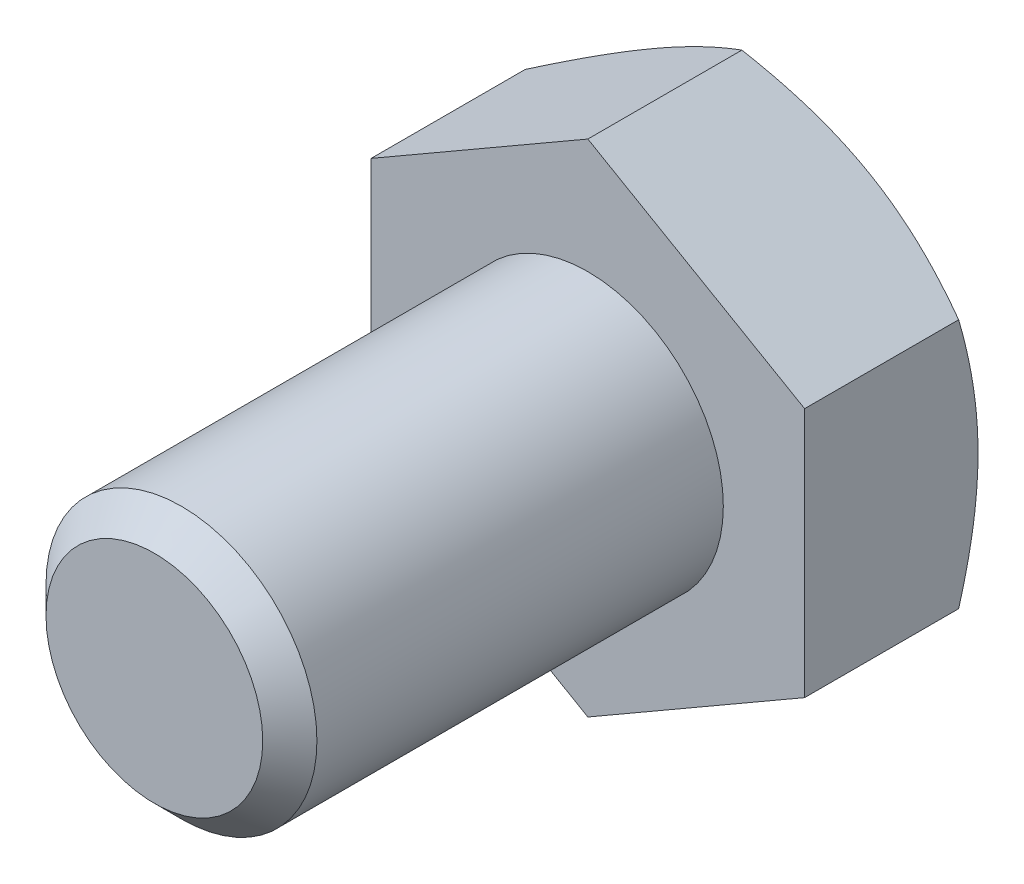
from build123d import *

# Parameters (mm, degrees)
ESQUISSE1_W        = 5
ESQUISSE1_H        = 16
CHANFREIN1_SIZE    = 1
BOSS_EXTRU_1_DEPTH = 6.4


with BuildPart() as part:
    # Esquisse1 → Base-R_volution (revolve)
    with BuildSketch(Plane(origin=(0, 0, 0), x_dir=(1, 0, 0), z_dir=(0, 1, 0))):
        with Locations((2.5, -8)):
            Rectangle(ESQUISSE1_W, ESQUISSE1_H)
    revolve(axis=Axis((0, 0, 0), (0, 0, 1)))

    # Chanfrein1
    chanfrein1_edges = [part.edges().sort_by_distance(p)[0] for p in [
        (-5, 0, 16),
    ]]
    chamfer(chanfrein1_edges, length=CHANFREIN1_SIZE)

    # Esquisse6 → Boss.-Extru.1 (add)
    with BuildSketch(Plane.XY):
        Polygon((8, -4.618802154), (8, 4.618802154), (0, 9.237604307), (-8, 4.618802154), (-8, -4.618802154), (0, -9.237604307), align=None)
    extrude(amount=-BOSS_EXTRU_1_DEPTH)

    # Esquisse7 → Enl_vement de mati_re-R_volution1 (revolve, cut)
    with BuildSketch(Plane(origin=(0, 0, 0), x_dir=(1, 0, 0), z_dir=(0, 1, 0))):
        Polygon((-8, 6.4), (-19.085125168, 6.4), (-19.085125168, 0), align=None)
    revolve(axis=Axis((0, 0, -6.239446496), (0, 0, 1)), mode=Mode.SUBTRACT)


solid = part.part
